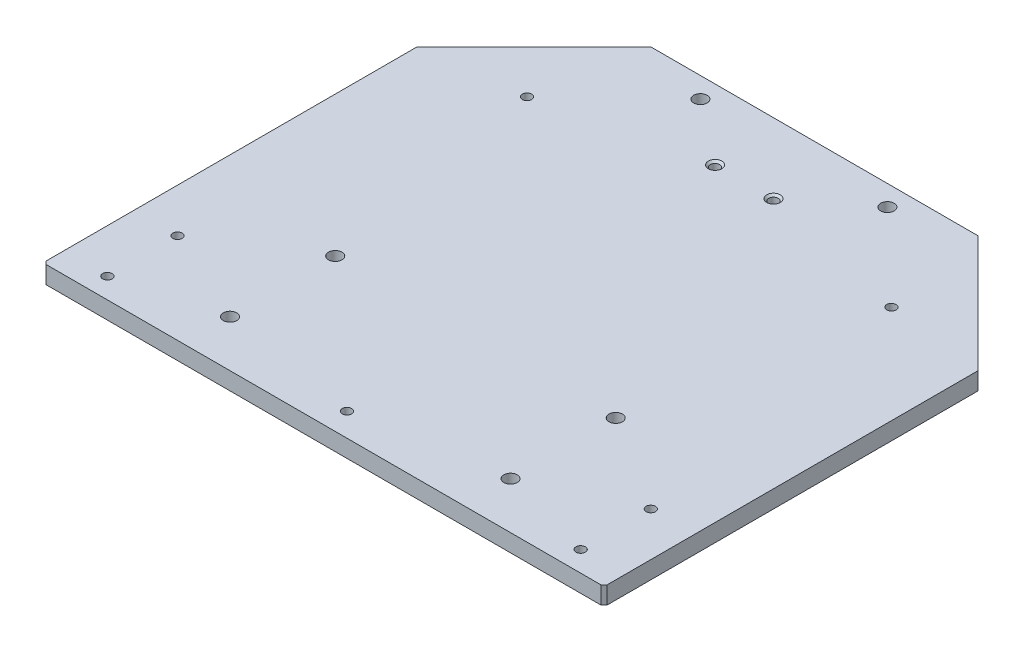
from build123d import *

# Parameters (mm, degrees)
SKETCH1_W                         = 304.8
SKETCH1_H                         = 266.7
BOSS_EXTRUDE1_DEPTH               = 9.525
F_1_4_20_TAPPED_HOLE1_AT_2_COUNT  = 2
F_1_4_20_TAPPED_HOLE1_AT_2_PITCH  = 198.0184
F_1_4_20_TAPPED_HOLE1_AT_3_COUNT  = 2
F_1_4_20_TAPPED_HOLE1_AT_3_PITCH  = 220.346872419
F_1_4_CLEARANCE_HOLE1_D           = 7.3152
F_1_4_CLEARANCE_HOLE2_D           = 7.3152
F_1_4_20_TAPPED_HOLE2_D           = 5.1054
F_1_4_20_TAPPED_HOLE2_CSINK_D     = 7.3152
F_1_4_20_TAPPED_HOLE2_CSINK_ANGLE = 90
CHAMFER1_SIZE                     = 1.5875
CHAMFER3_SIZE                     = 63.5
F_1_4_20_TAPPED_HOLE3_D           = 5.1054
F_1_4_20_TAPPED_HOLE3_CSINK_D     = 7.3152
F_1_4_20_TAPPED_HOLE3_CSINK_ANGLE = 90


with BuildPart() as part:
    # Sketch1 → Boss-Extrude1 (new body)
    with BuildSketch(Plane(origin=(0, 0, 0), x_dir=(1, 0, 0), z_dir=(0, 1, 0))):
        with Locations((0, -6.9342)):
            Rectangle(SKETCH1_W, SKETCH1_H)
    extrude(amount=BOSS_EXTRUDE1_DEPTH)

    # Sketch5 → 1_4-20 Tapped Hole1 (revolve, cut)
    with BuildSketch(Plane(origin=(-99.0092, 9.525, -69.2658), x_dir=(0, 0, 1), z_dir=(1, 0, 0))):
        Polygon((0, 0), (0, 9.525), (3.6576, 9.525), (2.5527, 8.4201), (2.5527, 0), align=None)
    f_1_4_20_tapped_hole1 = revolve(axis=Axis((-99.0092, 15.875, -69.2658), (0, -1, 0)), mode=Mode.SUBTRACT)

    # 1_4-20 Tapped Hole1 at 2: 1_4-20 Tapped Hole1 ×2
    with Locations(*[(i * F_1_4_20_TAPPED_HOLE1_AT_2_PITCH, 0, 0) for i in range(1, F_1_4_20_TAPPED_HOLE1_AT_2_COUNT)]):
        add(f_1_4_20_tapped_hole1, mode=Mode.SUBTRACT)

    # 1_4-20 Tapped Hole1 at 3: 1_4-20 Tapped Hole1 ×2
    with Locations(*[Vector(0.44933335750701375, 0, 0.8933641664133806) * (i * F_1_4_20_TAPPED_HOLE1_AT_3_PITCH) for i in range(1, F_1_4_20_TAPPED_HOLE1_AT_3_COUNT)]):
        add(f_1_4_20_tapped_hole1, mode=Mode.SUBTRACT)

    # 1_4 Clearance Hole1 (through all)
    with Locations(Plane(origin=(0, 0, 0), x_dir=(-1, 0, 0), z_dir=(0, -1, 0))):
        with Locations((127, 115.2906), (50.8, 115.2906), (-50.8, 115.2906), (-127, 115.2906)):
            Hole(F_1_4_CLEARANCE_HOLE1_D / 2)

    # 1_4 Clearance Hole2 (through all)
    with Locations(Plane(origin=(0, 0, 0), x_dir=(-1, 0, 0), z_dir=(0, -1, 0))):
        with Locations((-76.2, -57.7342), (-76.2, -114.8842), (76.2, -114.8842), (76.2, -57.7342)):
            Hole(F_1_4_CLEARANCE_HOLE2_D / 2)

    # 1_4-20 Tapped Hole2 (through all)
    with Locations(Plane(origin=(0, 0, 0), x_dir=(-1, 0, 0), z_dir=(0, -1, 0))):
        with Locations((128.5875, -129.159), (128.5875, -91.059), (-128.5748, -129.159), (-128.5748, -91.059)):
            CounterSinkHole(F_1_4_20_TAPPED_HOLE2_D / 2, F_1_4_20_TAPPED_HOLE2_CSINK_D / 2, counter_sink_angle=F_1_4_20_TAPPED_HOLE2_CSINK_ANGLE)

    # Chamfer1
    chamfer1_edges = [part.edges().sort_by_distance(p)[0] for p in [
        (152.4, 4.7625, 140.2842),
        (-152.4, 4.7625, 140.2842),
    ]]
    chamfer(chamfer1_edges, length=CHAMFER1_SIZE)

    # Chamfer3
    chamfer3_edges = [part.edges().sort_by_distance(p)[0] for p in [
        (152.4, 4.7625, -126.4158),
        (-152.4, 4.7625, -126.4158),
    ]]
    chamfer(chamfer3_edges, length=CHAMFER3_SIZE)

    # 1_4-20 Tapped Hole3 (through all)
    with Locations(Plane(origin=(0, 9.525, 0), x_dir=(1, 0, 0), z_dir=(0, 1, 0))):
        with Locations((-15.875, 88.3158), (15.875, 88.3158)):
            CounterSinkHole(F_1_4_20_TAPPED_HOLE3_D / 2, F_1_4_20_TAPPED_HOLE3_CSINK_D / 2, counter_sink_angle=F_1_4_20_TAPPED_HOLE3_CSINK_ANGLE)


solid = part.part
